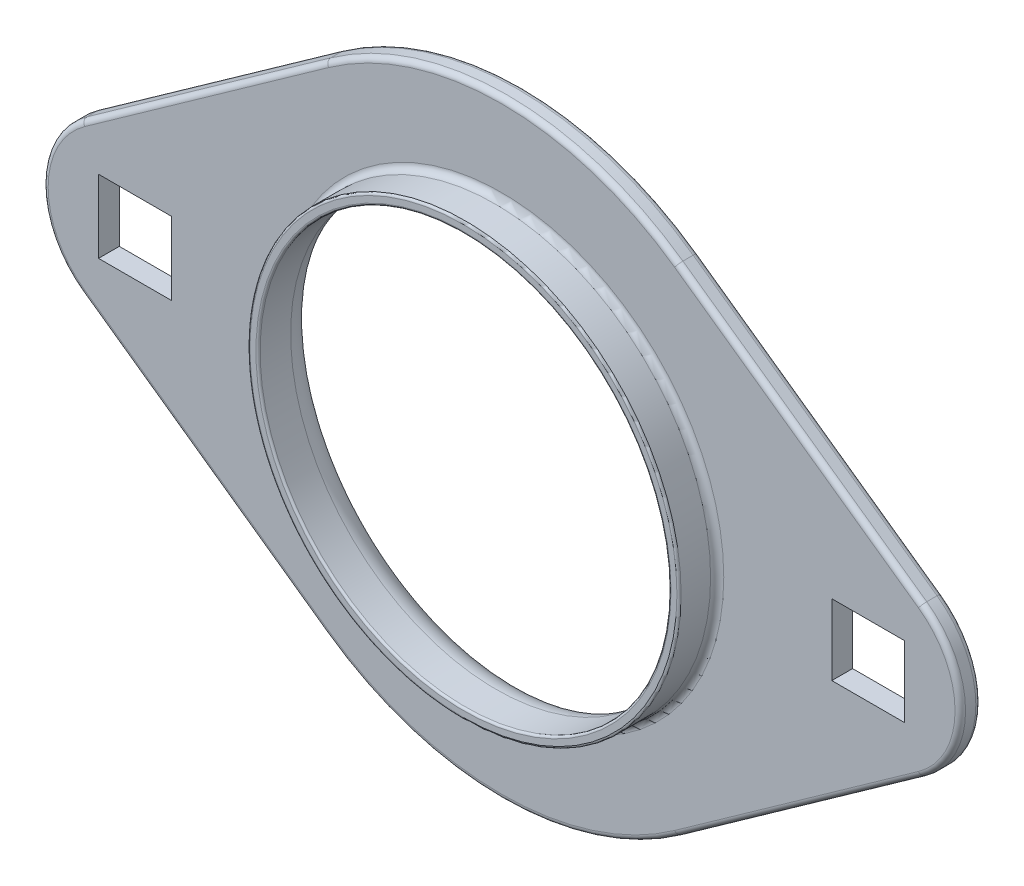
from build123d import *

# Parameters (mm, degrees)
SKETCH1_R      = 19.8374
SKETCH1_W      = 7.0358
SKETCH1_H      = 7.0358
SKETCH1_H_2    = 6.84784
EXTRUDE1_DEPTH = 1.0033
SKETCH2_R      = 20.8153
SKETCH2_R_2    = 19.8374
EXTRUDE2_DEPTH = 3.683
FILLET1_R      = 2.54
FILLET2_R      = 0.635
FILLET3_R      = 0.508
FILLET4_R      = 0.2032


with BuildPart() as part:
    # Sketch1 → Extrude1 (new, symmetric)
    with BuildSketch(Plane.XY):
        with BuildLine():
            Line((16.999259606, 23.95666239), (40.543319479, 7.250178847))
            ThreePointArc((40.543319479, 7.250178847), (44.28871, 0), (40.543319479, -7.250178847))
            Line((40.543319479, -7.250178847), (16.999259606, -23.95666239))
            ThreePointArc((16.999259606, -23.95666239), (0, -29.3751), (-16.999259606, -23.95666239))
            Line((-16.999259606, -23.95666239), (-40.543319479, -7.250178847))
            ThreePointArc((-40.543319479, -7.250178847), (-44.28871, 0), (-40.543319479, 7.250178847))
            Line((-40.543319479, 7.250178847), (-16.999259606, 23.95666239))
            ThreePointArc((-16.999259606, 23.95666239), (0, 29.3751), (16.999259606, 23.95666239))
        make_face()
        Circle(SKETCH1_R, mode=Mode.SUBTRACT)
        with Locations((-35.39998, 0)):
            Rectangle(SKETCH1_W, SKETCH1_H, mode=Mode.SUBTRACT)
        with Locations((35.39998, 0)):
            Rectangle(SKETCH1_W, SKETCH1_H_2, mode=Mode.SUBTRACT)
    extrude(amount=EXTRUDE1_DEPTH, both=True)

    # Sketch2 → Extrude2 (add)
    with BuildSketch(Plane.XY.offset(1.0033)):
        Circle(SKETCH2_R)
        Circle(SKETCH2_R_2, mode=Mode.SUBTRACT)
    extrude(amount=EXTRUDE2_DEPTH)

    # Fillet1
    fillet1_edges = [part.edges().sort_by_distance(p)[0] for p in [
        (-19.8374, 0, -1.0033),
    ]]
    fillet(fillet1_edges, radius=FILLET1_R)

    # Fillet2
    fillet2_edges = [part.edges().sort_by_distance(p)[0] for p in [
        (-20.8153, 0, 1.0033),
    ]]
    fillet(fillet2_edges, radius=FILLET2_R)

    # Fillet3
    fillet3_edges = [part.edges().sort_by_distance(p)[0] for p in [
        (-44.28871, 0, 1.0033),
        (-28.771289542, 15.603420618, -1.0033),
        (0, 29.3751, -1.0033),
        (-28.771289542, -15.603420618, 1.0033),
        (0, -29.3751, 1.0033),
        (28.771289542, -15.603420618, 1.0033),
        (44.28871, 0, 1.0033),
        (28.771289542, 15.603420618, 1.0033),
        (0, 29.3751, 1.0033),
        (-28.771289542, 15.603420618, 1.0033),
        (28.771289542, 15.603420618, -1.0033),
        (44.28871, 0, -1.0033),
        (28.771289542, -15.603420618, -1.0033),
        (0, -29.3751, -1.0033),
        (-28.771289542, -15.603420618, -1.0033),
        (-44.28871, 0, -1.0033),
    ]]
    fillet(fillet3_edges, radius=FILLET3_R)

    # Fillet4
    fillet4_edges = [part.edges().sort_by_distance(p)[0] for p in [
        (-20.8153, 0, 4.6863),
        (-19.8374, 0, 4.6863),
    ]]
    fillet(fillet4_edges, radius=FILLET4_R)


solid = part.part
